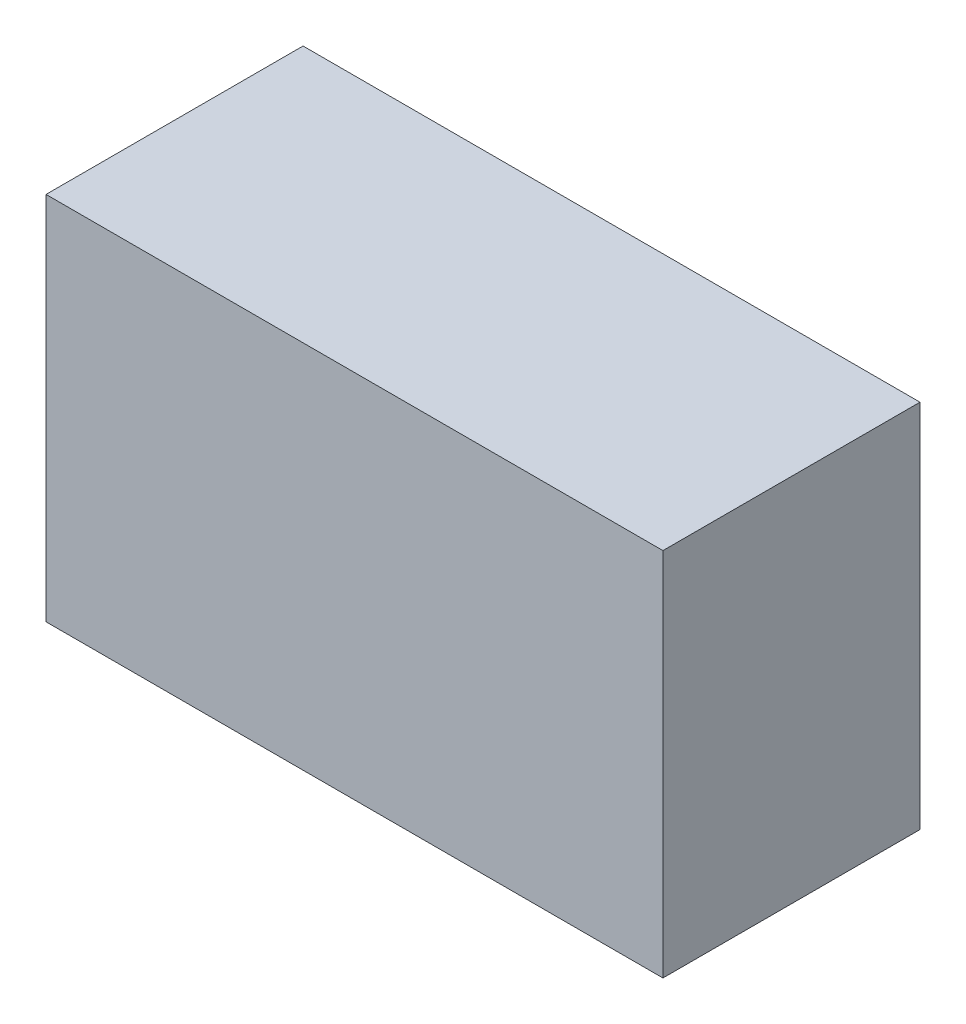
ISO-10303-21;
HEADER;
FILE_DESCRIPTION(('STEP AP214'),'2;1');
FILE_NAME('part.step','',(''),(''),'','','');
FILE_SCHEMA(('AUTOMOTIVE_DESIGN { 1 0 10303 214 1 1 1 1 }'));
ENDSEC;
DATA;
#1=APPLICATION_CONTEXT('core data for automotive mechanical design processes');
#2=APPLICATION_PROTOCOL_DEFINITION('international standard','automotive_design',2000,#1);
#3=PRODUCT_CONTEXT('',#1,'mechanical');
#4=PRODUCT('Part','Part','',(#3));
#5=PRODUCT_RELATED_PRODUCT_CATEGORY('part','',(#4));
#6=PRODUCT_DEFINITION_FORMATION('','',#4);
#7=PRODUCT_DEFINITION_CONTEXT('part definition',#1,'design');
#8=PRODUCT_DEFINITION('design','',#6,#7);
#9=PRODUCT_DEFINITION_SHAPE('','',#8);
#10=(LENGTH_UNIT() NAMED_UNIT(*) SI_UNIT(.MILLI.,.METRE.));
#11=(NAMED_UNIT(*) PLANE_ANGLE_UNIT() SI_UNIT($,.RADIAN.));
#12=(NAMED_UNIT(*) SI_UNIT($,.STERADIAN.) SOLID_ANGLE_UNIT());
#13=UNCERTAINTY_MEASURE_WITH_UNIT(LENGTH_MEASURE(1.E-05),#10,'distance_accuracy_value','');
#14=(GEOMETRIC_REPRESENTATION_CONTEXT(3) GLOBAL_UNCERTAINTY_ASSIGNED_CONTEXT((#13)) GLOBAL_UNIT_ASSIGNED_CONTEXT((#10,
#11,#12)) REPRESENTATION_CONTEXT('',''));
#15=CARTESIAN_POINT('',(0.,0.,0.));
#16=DIRECTION('',(0.,0.,1.));
#17=DIRECTION('',(1.,0.,0.));
#18=AXIS2_PLACEMENT_3D('',#15,#16,#17);
#19=CARTESIAN_POINT('',(0.,0.,1.25000004));
#20=DIRECTION('',(0.,0.,-1.));
#21=DIRECTION('',(0.,-1.,0.));
#22=AXIS2_PLACEMENT_3D('',#19,#20,#21);
#23=PLANE('',#22);
#24=DIRECTION('',(1.,0.,0.));
#25=VECTOR('',#24,1.);
#26=CARTESIAN_POINT('',(-1.49999954,0.90000074,1.25000004));
#27=LINE('',#26,#25);
#28=CARTESIAN_POINT('',(-1.49999954,0.90000074,1.25000004));
#29=VERTEX_POINT('',#28);
#30=CARTESIAN_POINT('',(1.49999954,0.90000074,1.25000004));
#31=VERTEX_POINT('',#30);
#32=EDGE_CURVE('E27',#29,#31,#27,.T.);
#33=ORIENTED_EDGE('',*,*,#32,.F.);
#34=DIRECTION('',(0.,1.,0.));
#35=VECTOR('',#34,1.);
#36=CARTESIAN_POINT('',(-1.49999954,-0.90000074,1.25000004));
#37=LINE('',#36,#35);
#38=CARTESIAN_POINT('',(-1.49999954,-0.90000074,1.25000004));
#39=VERTEX_POINT('',#38);
#40=EDGE_CURVE('E66',#39,#29,#37,.T.);
#41=ORIENTED_EDGE('',*,*,#40,.F.);
#42=DIRECTION('',(-1.,0.,0.));
#43=VECTOR('',#42,1.);
#44=CARTESIAN_POINT('',(1.49999954,-0.90000074,1.25000004));
#45=LINE('',#44,#43);
#46=CARTESIAN_POINT('',(1.49999954,-0.90000074,1.25000004));
#47=VERTEX_POINT('',#46);
#48=EDGE_CURVE('E93',#47,#39,#45,.T.);
#49=ORIENTED_EDGE('',*,*,#48,.F.);
#50=DIRECTION('',(0.,-1.,0.));
#51=VECTOR('',#50,1.);
#52=CARTESIAN_POINT('',(1.49999954,0.90000074,1.25000004));
#53=LINE('',#52,#51);
#54=EDGE_CURVE('E91',#31,#47,#53,.T.);
#55=ORIENTED_EDGE('',*,*,#54,.F.);
#56=EDGE_LOOP('',(#33,#41,#49,#55));
#57=FACE_BOUND('',#56,.T.);
#58=ADVANCED_FACE('F17',(#57),#23,.F.);
#59=CARTESIAN_POINT('',(0.,0.,0.));
#60=DIRECTION('',(0.,0.,-1.));
#61=DIRECTION('',(0.,-1.,0.));
#62=AXIS2_PLACEMENT_3D('',#59,#60,#61);
#63=PLANE('',#62);
#64=DIRECTION('',(0.,-1.,0.));
#65=VECTOR('',#64,1.);
#66=CARTESIAN_POINT('',(1.49999954,0.90000074,0.));
#67=LINE('',#66,#65);
#68=CARTESIAN_POINT('',(1.49999954,0.90000074,0.));
#69=VERTEX_POINT('',#68);
#70=CARTESIAN_POINT('',(1.49999954,-0.90000074,0.));
#71=VERTEX_POINT('',#70);
#72=EDGE_CURVE('E100',#69,#71,#67,.T.);
#73=ORIENTED_EDGE('',*,*,#72,.T.);
#74=DIRECTION('',(-1.,0.,0.));
#75=VECTOR('',#74,1.);
#76=CARTESIAN_POINT('',(1.49999954,-0.90000074,0.));
#77=LINE('',#76,#75);
#78=CARTESIAN_POINT('',(-1.49999954,-0.90000074,0.));
#79=VERTEX_POINT('',#78);
#80=EDGE_CURVE('E58',#71,#79,#77,.T.);
#81=ORIENTED_EDGE('',*,*,#80,.T.);
#82=DIRECTION('',(0.,1.,0.));
#83=VECTOR('',#82,1.);
#84=CARTESIAN_POINT('',(-1.49999954,-0.90000074,0.));
#85=LINE('',#84,#83);
#86=CARTESIAN_POINT('',(-1.49999954,0.90000074,0.));
#87=VERTEX_POINT('',#86);
#88=EDGE_CURVE('E74',#79,#87,#85,.T.);
#89=ORIENTED_EDGE('',*,*,#88,.T.);
#90=DIRECTION('',(1.,0.,0.));
#91=VECTOR('',#90,1.);
#92=CARTESIAN_POINT('',(-1.49999954,0.90000074,0.));
#93=LINE('',#92,#91);
#94=EDGE_CURVE('E11',#87,#69,#93,.T.);
#95=ORIENTED_EDGE('',*,*,#94,.T.);
#96=EDGE_LOOP('',(#73,#81,#89,#95));
#97=FACE_BOUND('',#96,.T.);
#98=ADVANCED_FACE('F19',(#97),#63,.T.);
#99=CARTESIAN_POINT('',(-1.49999954,0.90000074,0.));
#100=DIRECTION('',(0.,1.,0.));
#101=DIRECTION('',(1.,0.,0.));
#102=AXIS2_PLACEMENT_3D('',#99,#100,#101);
#103=PLANE('',#102);
#104=DIRECTION('',(0.,0.,1.));
#105=VECTOR('',#104,1.);
#106=CARTESIAN_POINT('',(-1.49999954,0.90000074,0.));
#107=LINE('',#106,#105);
#108=EDGE_CURVE('E87',#87,#29,#107,.T.);
#109=ORIENTED_EDGE('',*,*,#108,.T.);
#110=ORIENTED_EDGE('',*,*,#32,.T.);
#111=DIRECTION('',(0.,0.,1.));
#112=VECTOR('',#111,1.);
#113=CARTESIAN_POINT('',(1.49999954,0.90000074,0.));
#114=LINE('',#113,#112);
#115=EDGE_CURVE('E86',#69,#31,#114,.T.);
#116=ORIENTED_EDGE('',*,*,#115,.F.);
#117=ORIENTED_EDGE('',*,*,#94,.F.);
#118=EDGE_LOOP('',(#109,#110,#116,#117));
#119=FACE_BOUND('',#118,.T.);
#120=ADVANCED_FACE('F84',(#119),#103,.T.);
#121=CARTESIAN_POINT('',(-1.49999954,-0.90000074,0.));
#122=DIRECTION('',(-1.,0.,0.));
#123=DIRECTION('',(0.,0.,1.));
#124=AXIS2_PLACEMENT_3D('',#121,#122,#123);
#125=PLANE('',#124);
#126=DIRECTION('',(0.,0.,1.));
#127=VECTOR('',#126,1.);
#128=CARTESIAN_POINT('',(-1.49999954,-0.90000074,0.));
#129=LINE('',#128,#127);
#130=EDGE_CURVE('E112',#79,#39,#129,.T.);
#131=ORIENTED_EDGE('',*,*,#130,.T.);
#132=ORIENTED_EDGE('',*,*,#40,.T.);
#133=ORIENTED_EDGE('',*,*,#108,.F.);
#134=ORIENTED_EDGE('',*,*,#88,.F.);
#135=EDGE_LOOP('',(#131,#132,#133,#134));
#136=FACE_BOUND('',#135,.T.);
#137=ADVANCED_FACE('F123',(#136),#125,.T.);
#138=CARTESIAN_POINT('',(1.49999954,-0.90000074,0.));
#139=DIRECTION('',(0.,-1.,0.));
#140=DIRECTION('',(0.,0.,-1.));
#141=AXIS2_PLACEMENT_3D('',#138,#139,#140);
#142=PLANE('',#141);
#143=DIRECTION('',(0.,0.,1.));
#144=VECTOR('',#143,1.);
#145=CARTESIAN_POINT('',(1.49999954,-0.90000074,0.));
#146=LINE('',#145,#144);
#147=EDGE_CURVE('E97',#71,#47,#146,.T.);
#148=ORIENTED_EDGE('',*,*,#147,.T.);
#149=ORIENTED_EDGE('',*,*,#48,.T.);
#150=ORIENTED_EDGE('',*,*,#130,.F.);
#151=ORIENTED_EDGE('',*,*,#80,.F.);
#152=EDGE_LOOP('',(#148,#149,#150,#151));
#153=FACE_BOUND('',#152,.T.);
#154=ADVANCED_FACE('F124',(#153),#142,.T.);
#155=CARTESIAN_POINT('',(1.49999954,0.90000074,0.));
#156=DIRECTION('',(1.,0.,0.));
#157=DIRECTION('',(0.,1.,0.));
#158=AXIS2_PLACEMENT_3D('',#155,#156,#157);
#159=PLANE('',#158);
#160=ORIENTED_EDGE('',*,*,#115,.T.);
#161=ORIENTED_EDGE('',*,*,#54,.T.);
#162=ORIENTED_EDGE('',*,*,#147,.F.);
#163=ORIENTED_EDGE('',*,*,#72,.F.);
#164=EDGE_LOOP('',(#160,#161,#162,#163));
#165=FACE_BOUND('',#164,.T.);
#166=ADVANCED_FACE('F99',(#165),#159,.T.);
#167=CLOSED_SHELL('',(#58,#98,#120,#137,#154,#166));
#168=MANIFOLD_SOLID_BREP('B1',#167);
#169=ADVANCED_BREP_SHAPE_REPRESENTATION('',(#18,#168),#14);
#170=SHAPE_DEFINITION_REPRESENTATION(#9,#169);
ENDSEC;
END-ISO-10303-21;
